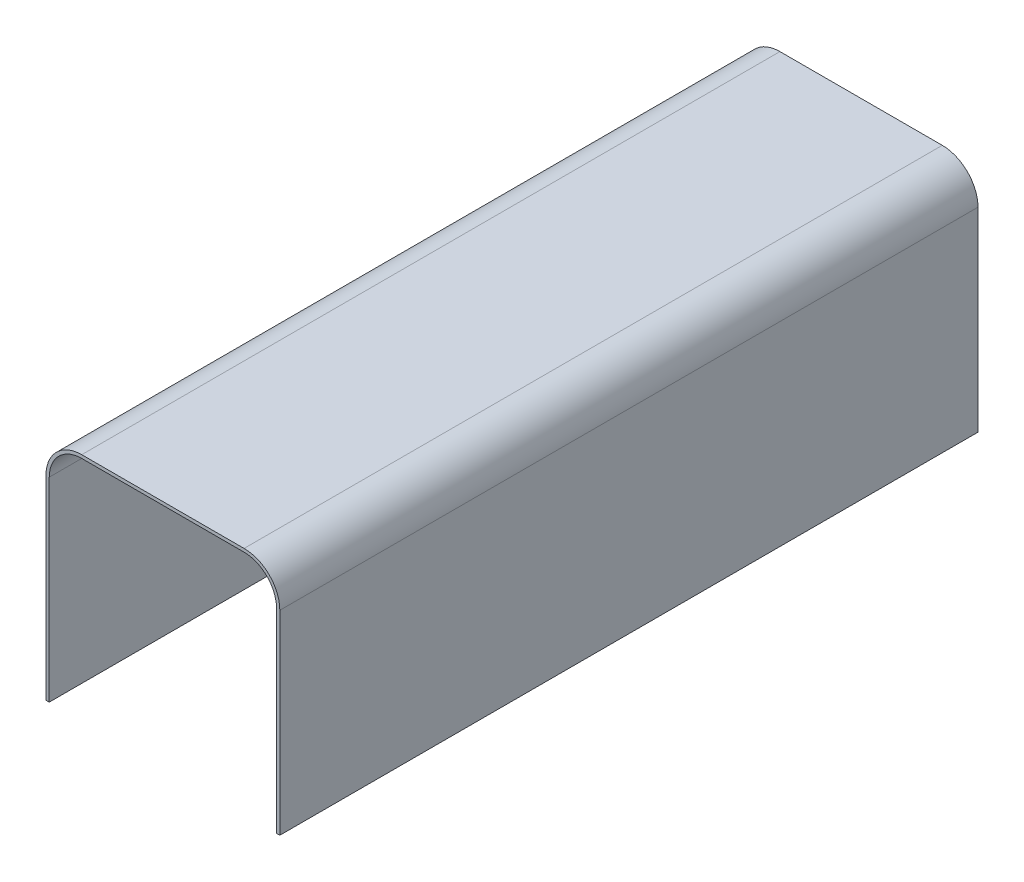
ISO-10303-21;
HEADER;
FILE_DESCRIPTION(('STEP AP214'),'2;1');
FILE_NAME('part.step','',(''),(''),'','','');
FILE_SCHEMA(('AUTOMOTIVE_DESIGN { 1 0 10303 214 1 1 1 1 }'));
ENDSEC;
DATA;
#1=APPLICATION_CONTEXT('core data for automotive mechanical design processes');
#2=APPLICATION_PROTOCOL_DEFINITION('international standard','automotive_design',2000,#1);
#3=PRODUCT_CONTEXT('',#1,'mechanical');
#4=PRODUCT('Part','Part','',(#3));
#5=PRODUCT_RELATED_PRODUCT_CATEGORY('part','',(#4));
#6=PRODUCT_DEFINITION_FORMATION('','',#4);
#7=PRODUCT_DEFINITION_CONTEXT('part definition',#1,'design');
#8=PRODUCT_DEFINITION('design','',#6,#7);
#9=PRODUCT_DEFINITION_SHAPE('','',#8);
#10=(LENGTH_UNIT() NAMED_UNIT(*) SI_UNIT(.MILLI.,.METRE.));
#11=(NAMED_UNIT(*) PLANE_ANGLE_UNIT() SI_UNIT($,.RADIAN.));
#12=(NAMED_UNIT(*) SI_UNIT($,.STERADIAN.) SOLID_ANGLE_UNIT());
#13=UNCERTAINTY_MEASURE_WITH_UNIT(LENGTH_MEASURE(1.E-05),#10,'distance_accuracy_value','');
#14=(GEOMETRIC_REPRESENTATION_CONTEXT(3) GLOBAL_UNCERTAINTY_ASSIGNED_CONTEXT((#13)) GLOBAL_UNIT_ASSIGNED_CONTEXT((#10,
#11,#12)) REPRESENTATION_CONTEXT('',''));
#15=CARTESIAN_POINT('',(0.,0.,0.));
#16=DIRECTION('',(0.,0.,1.));
#17=DIRECTION('',(1.,0.,0.));
#18=AXIS2_PLACEMENT_3D('',#15,#16,#17);
#19=CARTESIAN_POINT('',(-1.,0.,215.));
#20=DIRECTION('',(0.,1.,0.));
#21=DIRECTION('',(0.,0.,1.));
#22=AXIS2_PLACEMENT_3D('',#19,#20,#21);
#23=PLANE('',#22);
#24=DIRECTION('',(1.,0.,0.));
#25=VECTOR('',#24,1.);
#26=CARTESIAN_POINT('',(-1.,0.,0.));
#27=LINE('',#26,#25);
#28=CARTESIAN_POINT('',(-1.,0.,0.));
#29=VERTEX_POINT('',#28);
#30=CARTESIAN_POINT('',(0.,0.,0.));
#31=VERTEX_POINT('',#30);
#32=EDGE_CURVE('E153',#29,#31,#27,.T.);
#33=ORIENTED_EDGE('',*,*,#32,.T.);
#34=DIRECTION('',(0.,0.,-1.));
#35=VECTOR('',#34,1.);
#36=CARTESIAN_POINT('',(0.,0.,215.));
#37=LINE('',#36,#35);
#38=CARTESIAN_POINT('',(0.,0.,215.));
#39=VERTEX_POINT('',#38);
#40=EDGE_CURVE('E11',#39,#31,#37,.T.);
#41=ORIENTED_EDGE('',*,*,#40,.F.);
#42=DIRECTION('',(1.,0.,0.));
#43=VECTOR('',#42,1.);
#44=CARTESIAN_POINT('',(-1.,0.,215.));
#45=LINE('',#44,#43);
#46=CARTESIAN_POINT('',(-1.,0.,215.));
#47=VERTEX_POINT('',#46);
#48=EDGE_CURVE('E175',#47,#39,#45,.T.);
#49=ORIENTED_EDGE('',*,*,#48,.F.);
#50=DIRECTION('',(0.,0.,-1.));
#51=VECTOR('',#50,1.);
#52=CARTESIAN_POINT('',(-1.,0.,215.));
#53=LINE('',#52,#51);
#54=EDGE_CURVE('E149',#47,#29,#53,.T.);
#55=ORIENTED_EDGE('',*,*,#54,.T.);
#56=EDGE_LOOP('',(#33,#41,#49,#55));
#57=FACE_BOUND('',#56,.T.);
#58=ADVANCED_FACE('F33',(#57),#23,.F.);
#59=CARTESIAN_POINT('',(0.,0.,215.));
#60=DIRECTION('',(-1.,0.,0.));
#61=DIRECTION('',(0.,0.,1.));
#62=AXIS2_PLACEMENT_3D('',#59,#60,#61);
#63=PLANE('',#62);
#64=DIRECTION('',(0.,1.,0.));
#65=VECTOR('',#64,1.);
#66=CARTESIAN_POINT('',(0.,0.,0.));
#67=LINE('',#66,#65);
#68=CARTESIAN_POINT('',(0.,59.9999999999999,0.));
#69=VERTEX_POINT('',#68);
#70=EDGE_CURVE('E156',#31,#69,#67,.T.);
#71=ORIENTED_EDGE('',*,*,#70,.T.);
#72=DIRECTION('',(0.,0.,-1.));
#73=VECTOR('',#72,1.);
#74=CARTESIAN_POINT('',(0.,59.9999999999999,215.));
#75=LINE('',#74,#73);
#76=CARTESIAN_POINT('',(0.,59.9999999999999,215.));
#77=VERTEX_POINT('',#76);
#78=EDGE_CURVE('E41',#77,#69,#75,.T.);
#79=ORIENTED_EDGE('',*,*,#78,.F.);
#80=DIRECTION('',(0.,1.,0.));
#81=VECTOR('',#80,1.);
#82=CARTESIAN_POINT('',(0.,0.,215.));
#83=LINE('',#82,#81);
#84=EDGE_CURVE('E104',#39,#77,#83,.T.);
#85=ORIENTED_EDGE('',*,*,#84,.F.);
#86=ORIENTED_EDGE('',*,*,#40,.T.);
#87=EDGE_LOOP('',(#71,#79,#85,#86));
#88=FACE_BOUND('',#87,.T.);
#89=ADVANCED_FACE('F253',(#88),#63,.F.);
#90=CARTESIAN_POINT('',(10.,60.,215.));
#91=DIRECTION('',(0.,0.,-1.));
#92=DIRECTION('',(-1.,0.,0.));
#93=AXIS2_PLACEMENT_3D('',#90,#91,#92);
#94=CYLINDRICAL_SURFACE('',#93,10.);
#95=CARTESIAN_POINT('',(10.,60.,0.));
#96=DIRECTION('',(0.,0.,-1.));
#97=DIRECTION('',(-1.,0.,0.));
#98=AXIS2_PLACEMENT_3D('',#95,#96,#97);
#99=CIRCLE('',#98,10.);
#100=CARTESIAN_POINT('',(10.0000000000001,70.,0.));
#101=VERTEX_POINT('',#100);
#102=EDGE_CURVE('E158',#69,#101,#99,.T.);
#103=ORIENTED_EDGE('',*,*,#102,.T.);
#104=DIRECTION('',(0.,0.,-1.));
#105=VECTOR('',#104,1.);
#106=CARTESIAN_POINT('',(10.0000000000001,70.,215.));
#107=LINE('',#106,#105);
#108=CARTESIAN_POINT('',(10.0000000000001,70.,215.));
#109=VERTEX_POINT('',#108);
#110=EDGE_CURVE('E194',#109,#101,#107,.T.);
#111=ORIENTED_EDGE('',*,*,#110,.F.);
#112=CARTESIAN_POINT('',(10.,60.,215.));
#113=DIRECTION('',(0.,0.,-1.));
#114=DIRECTION('',(-1.,0.,0.));
#115=AXIS2_PLACEMENT_3D('',#112,#113,#114);
#116=CIRCLE('',#115,10.);
#117=EDGE_CURVE('E202',#77,#109,#116,.T.);
#118=ORIENTED_EDGE('',*,*,#117,.F.);
#119=ORIENTED_EDGE('',*,*,#78,.T.);
#120=EDGE_LOOP('',(#103,#111,#118,#119));
#121=FACE_BOUND('',#120,.T.);
#122=ADVANCED_FACE('F200',(#121),#94,.F.);
#123=CARTESIAN_POINT('',(10.0000000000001,70.,215.));
#124=DIRECTION('',(0.,1.,0.));
#125=DIRECTION('',(0.,0.,1.));
#126=AXIS2_PLACEMENT_3D('',#123,#124,#125);
#127=PLANE('',#126);
#128=DIRECTION('',(1.,0.,0.));
#129=VECTOR('',#128,1.);
#130=CARTESIAN_POINT('',(10.0000000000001,70.,0.));
#131=LINE('',#130,#129);
#132=CARTESIAN_POINT('',(59.9999999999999,70.,0.));
#133=VERTEX_POINT('',#132);
#134=EDGE_CURVE('E160',#101,#133,#131,.T.);
#135=ORIENTED_EDGE('',*,*,#134,.T.);
#136=DIRECTION('',(0.,0.,-1.));
#137=VECTOR('',#136,1.);
#138=CARTESIAN_POINT('',(59.9999999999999,70.,215.));
#139=LINE('',#138,#137);
#140=CARTESIAN_POINT('',(59.9999999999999,70.,215.));
#141=VERTEX_POINT('',#140);
#142=EDGE_CURVE('E191',#141,#133,#139,.T.);
#143=ORIENTED_EDGE('',*,*,#142,.F.);
#144=DIRECTION('',(1.,0.,0.));
#145=VECTOR('',#144,1.);
#146=CARTESIAN_POINT('',(10.0000000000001,70.,215.));
#147=LINE('',#146,#145);
#148=EDGE_CURVE('E220',#109,#141,#147,.T.);
#149=ORIENTED_EDGE('',*,*,#148,.F.);
#150=ORIENTED_EDGE('',*,*,#110,.T.);
#151=EDGE_LOOP('',(#135,#143,#149,#150));
#152=FACE_BOUND('',#151,.T.);
#153=ADVANCED_FACE('F211',(#152),#127,.F.);
#154=CARTESIAN_POINT('',(60.,60.,215.));
#155=DIRECTION('',(0.,0.,-1.));
#156=DIRECTION('',(-1.,0.,0.));
#157=AXIS2_PLACEMENT_3D('',#154,#155,#156);
#158=CYLINDRICAL_SURFACE('',#157,10.);
#159=CARTESIAN_POINT('',(60.,60.,0.));
#160=DIRECTION('',(0.,0.,-1.));
#161=DIRECTION('',(-1.,0.,0.));
#162=AXIS2_PLACEMENT_3D('',#159,#160,#161);
#163=CIRCLE('',#162,10.);
#164=CARTESIAN_POINT('',(70.,59.9999999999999,0.));
#165=VERTEX_POINT('',#164);
#166=EDGE_CURVE('E162',#133,#165,#163,.T.);
#167=ORIENTED_EDGE('',*,*,#166,.T.);
#168=DIRECTION('',(0.,0.,-1.));
#169=VECTOR('',#168,1.);
#170=CARTESIAN_POINT('',(70.,59.9999999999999,215.));
#171=LINE('',#170,#169);
#172=CARTESIAN_POINT('',(70.,59.9999999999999,215.));
#173=VERTEX_POINT('',#172);
#174=EDGE_CURVE('E188',#173,#165,#171,.T.);
#175=ORIENTED_EDGE('',*,*,#174,.F.);
#176=CARTESIAN_POINT('',(60.,60.,215.));
#177=DIRECTION('',(0.,0.,-1.));
#178=DIRECTION('',(-1.,0.,0.));
#179=AXIS2_PLACEMENT_3D('',#176,#177,#178);
#180=CIRCLE('',#179,10.);
#181=EDGE_CURVE('E217',#141,#173,#180,.T.);
#182=ORIENTED_EDGE('',*,*,#181,.F.);
#183=ORIENTED_EDGE('',*,*,#142,.T.);
#184=EDGE_LOOP('',(#167,#175,#182,#183));
#185=FACE_BOUND('',#184,.T.);
#186=ADVANCED_FACE('F215',(#185),#158,.F.);
#187=CARTESIAN_POINT('',(70.,59.9999999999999,215.));
#188=DIRECTION('',(1.,0.,0.));
#189=DIRECTION('',(0.,1.,0.));
#190=AXIS2_PLACEMENT_3D('',#187,#188,#189);
#191=PLANE('',#190);
#192=DIRECTION('',(0.,-1.,0.));
#193=VECTOR('',#192,1.);
#194=CARTESIAN_POINT('',(70.,59.9999999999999,0.));
#195=LINE('',#194,#193);
#196=CARTESIAN_POINT('',(70.,0.,0.));
#197=VERTEX_POINT('',#196);
#198=EDGE_CURVE('E164',#165,#197,#195,.T.);
#199=ORIENTED_EDGE('',*,*,#198,.T.);
#200=DIRECTION('',(0.,0.,-1.));
#201=VECTOR('',#200,1.);
#202=CARTESIAN_POINT('',(70.,0.,215.));
#203=LINE('',#202,#201);
#204=CARTESIAN_POINT('',(70.,0.,215.));
#205=VERTEX_POINT('',#204);
#206=EDGE_CURVE('E185',#205,#197,#203,.T.);
#207=ORIENTED_EDGE('',*,*,#206,.F.);
#208=DIRECTION('',(0.,-1.,0.));
#209=VECTOR('',#208,1.);
#210=CARTESIAN_POINT('',(70.,59.9999999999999,215.));
#211=LINE('',#210,#209);
#212=EDGE_CURVE('E219',#173,#205,#211,.T.);
#213=ORIENTED_EDGE('',*,*,#212,.F.);
#214=ORIENTED_EDGE('',*,*,#174,.T.);
#215=EDGE_LOOP('',(#199,#207,#213,#214));
#216=FACE_BOUND('',#215,.T.);
#217=ADVANCED_FACE('F266',(#216),#191,.F.);
#218=CARTESIAN_POINT('',(70.,0.,215.));
#219=DIRECTION('',(0.,1.,0.));
#220=DIRECTION('',(0.,0.,1.));
#221=AXIS2_PLACEMENT_3D('',#218,#219,#220);
#222=PLANE('',#221);
#223=DIRECTION('',(1.,0.,0.));
#224=VECTOR('',#223,1.);
#225=CARTESIAN_POINT('',(70.,0.,0.));
#226=LINE('',#225,#224);
#227=CARTESIAN_POINT('',(71.,0.,0.));
#228=VERTEX_POINT('',#227);
#229=EDGE_CURVE('E166',#197,#228,#226,.T.);
#230=ORIENTED_EDGE('',*,*,#229,.T.);
#231=DIRECTION('',(0.,0.,-1.));
#232=VECTOR('',#231,1.);
#233=CARTESIAN_POINT('',(71.,0.,215.));
#234=LINE('',#233,#232);
#235=CARTESIAN_POINT('',(71.,0.,215.));
#236=VERTEX_POINT('',#235);
#237=EDGE_CURVE('E182',#236,#228,#234,.T.);
#238=ORIENTED_EDGE('',*,*,#237,.F.);
#239=DIRECTION('',(1.,0.,0.));
#240=VECTOR('',#239,1.);
#241=CARTESIAN_POINT('',(70.,0.,215.));
#242=LINE('',#241,#240);
#243=EDGE_CURVE('E222',#205,#236,#242,.T.);
#244=ORIENTED_EDGE('',*,*,#243,.F.);
#245=ORIENTED_EDGE('',*,*,#206,.T.);
#246=EDGE_LOOP('',(#230,#238,#244,#245));
#247=FACE_BOUND('',#246,.T.);
#248=ADVANCED_FACE('F269',(#247),#222,.F.);
#249=CARTESIAN_POINT('',(71.,59.9999999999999,215.));
#250=DIRECTION('',(-1.,0.,0.));
#251=DIRECTION('',(0.,0.,1.));
#252=AXIS2_PLACEMENT_3D('',#249,#250,#251);
#253=PLANE('',#252);
#254=DIRECTION('',(0.,1.,0.));
#255=VECTOR('',#254,1.);
#256=CARTESIAN_POINT('',(71.,59.9999999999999,0.));
#257=LINE('',#256,#255);
#258=CARTESIAN_POINT('',(71.,59.9999999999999,0.));
#259=VERTEX_POINT('',#258);
#260=EDGE_CURVE('E168',#228,#259,#257,.T.);
#261=ORIENTED_EDGE('',*,*,#260,.T.);
#262=DIRECTION('',(0.,0.,-1.));
#263=VECTOR('',#262,1.);
#264=CARTESIAN_POINT('',(71.,59.9999999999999,215.));
#265=LINE('',#264,#263);
#266=CARTESIAN_POINT('',(71.,59.9999999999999,215.));
#267=VERTEX_POINT('',#266);
#268=EDGE_CURVE('E179',#267,#259,#265,.T.);
#269=ORIENTED_EDGE('',*,*,#268,.F.);
#270=DIRECTION('',(0.,1.,0.));
#271=VECTOR('',#270,1.);
#272=CARTESIAN_POINT('',(71.,59.9999999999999,215.));
#273=LINE('',#272,#271);
#274=EDGE_CURVE('E228',#236,#267,#273,.T.);
#275=ORIENTED_EDGE('',*,*,#274,.F.);
#276=ORIENTED_EDGE('',*,*,#237,.T.);
#277=EDGE_LOOP('',(#261,#269,#275,#276));
#278=FACE_BOUND('',#277,.T.);
#279=ADVANCED_FACE('F234',(#278),#253,.F.);
#280=CARTESIAN_POINT('',(60.,60.,215.));
#281=DIRECTION('',(0.,0.,-1.));
#282=DIRECTION('',(-1.,0.,0.));
#283=AXIS2_PLACEMENT_3D('',#280,#281,#282);
#284=CYLINDRICAL_SURFACE('',#283,11.);
#285=CARTESIAN_POINT('',(60.,60.,0.));
#286=DIRECTION('',(0.,0.,1.));
#287=DIRECTION('',(-1.,0.,0.));
#288=AXIS2_PLACEMENT_3D('',#285,#286,#287);
#289=CIRCLE('',#288,11.);
#290=CARTESIAN_POINT('',(59.9999999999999,71.,0.));
#291=VERTEX_POINT('',#290);
#292=EDGE_CURVE('E170',#259,#291,#289,.T.);
#293=ORIENTED_EDGE('',*,*,#292,.T.);
#294=DIRECTION('',(0.,0.,-1.));
#295=VECTOR('',#294,1.);
#296=CARTESIAN_POINT('',(59.9999999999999,71.,215.));
#297=LINE('',#296,#295);
#298=CARTESIAN_POINT('',(59.9999999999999,71.,215.));
#299=VERTEX_POINT('',#298);
#300=EDGE_CURVE('E144',#299,#291,#297,.T.);
#301=ORIENTED_EDGE('',*,*,#300,.F.);
#302=CARTESIAN_POINT('',(60.,60.,215.));
#303=DIRECTION('',(0.,0.,1.));
#304=DIRECTION('',(-1.,0.,0.));
#305=AXIS2_PLACEMENT_3D('',#302,#303,#304);
#306=CIRCLE('',#305,11.);
#307=EDGE_CURVE('E135',#267,#299,#306,.T.);
#308=ORIENTED_EDGE('',*,*,#307,.F.);
#309=ORIENTED_EDGE('',*,*,#268,.T.);
#310=EDGE_LOOP('',(#293,#301,#308,#309));
#311=FACE_BOUND('',#310,.T.);
#312=ADVANCED_FACE('F238',(#311),#284,.T.);
#313=CARTESIAN_POINT('',(10.0000000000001,71.,215.));
#314=DIRECTION('',(0.,-1.,0.));
#315=DIRECTION('',(0.,0.,-1.));
#316=AXIS2_PLACEMENT_3D('',#313,#314,#315);
#317=PLANE('',#316);
#318=DIRECTION('',(-1.,0.,0.));
#319=VECTOR('',#318,1.);
#320=CARTESIAN_POINT('',(10.0000000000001,71.,0.));
#321=LINE('',#320,#319);
#322=CARTESIAN_POINT('',(10.0000000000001,71.,0.));
#323=VERTEX_POINT('',#322);
#324=EDGE_CURVE('E143',#291,#323,#321,.T.);
#325=ORIENTED_EDGE('',*,*,#324,.T.);
#326=DIRECTION('',(0.,0.,-1.));
#327=VECTOR('',#326,1.);
#328=CARTESIAN_POINT('',(10.0000000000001,71.,215.));
#329=LINE('',#328,#327);
#330=CARTESIAN_POINT('',(10.0000000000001,71.,215.));
#331=VERTEX_POINT('',#330);
#332=EDGE_CURVE('E140',#331,#323,#329,.T.);
#333=ORIENTED_EDGE('',*,*,#332,.F.);
#334=DIRECTION('',(-1.,0.,0.));
#335=VECTOR('',#334,1.);
#336=CARTESIAN_POINT('',(10.0000000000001,71.,215.));
#337=LINE('',#336,#335);
#338=EDGE_CURVE('E129',#299,#331,#337,.T.);
#339=ORIENTED_EDGE('',*,*,#338,.F.);
#340=ORIENTED_EDGE('',*,*,#300,.T.);
#341=EDGE_LOOP('',(#325,#333,#339,#340));
#342=FACE_BOUND('',#341,.T.);
#343=ADVANCED_FACE('F141',(#342),#317,.F.);
#344=CARTESIAN_POINT('',(10.,60.,215.));
#345=DIRECTION('',(0.,0.,-1.));
#346=DIRECTION('',(-1.,0.,0.));
#347=AXIS2_PLACEMENT_3D('',#344,#345,#346);
#348=CYLINDRICAL_SURFACE('',#347,11.);
#349=CARTESIAN_POINT('',(10.,60.,0.));
#350=DIRECTION('',(0.,0.,1.));
#351=DIRECTION('',(-1.,0.,0.));
#352=AXIS2_PLACEMENT_3D('',#349,#350,#351);
#353=CIRCLE('',#352,11.);
#354=CARTESIAN_POINT('',(-1.,59.9999999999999,0.));
#355=VERTEX_POINT('',#354);
#356=EDGE_CURVE('E90',#323,#355,#353,.T.);
#357=ORIENTED_EDGE('',*,*,#356,.T.);
#358=DIRECTION('',(0.,0.,-1.));
#359=VECTOR('',#358,1.);
#360=CARTESIAN_POINT('',(-1.,59.9999999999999,215.));
#361=LINE('',#360,#359);
#362=CARTESIAN_POINT('',(-1.,59.9999999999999,215.));
#363=VERTEX_POINT('',#362);
#364=EDGE_CURVE('E145',#363,#355,#361,.T.);
#365=ORIENTED_EDGE('',*,*,#364,.F.);
#366=CARTESIAN_POINT('',(10.,60.,215.));
#367=DIRECTION('',(0.,0.,1.));
#368=DIRECTION('',(-1.,0.,0.));
#369=AXIS2_PLACEMENT_3D('',#366,#367,#368);
#370=CIRCLE('',#369,11.);
#371=EDGE_CURVE('E133',#331,#363,#370,.T.);
#372=ORIENTED_EDGE('',*,*,#371,.F.);
#373=ORIENTED_EDGE('',*,*,#332,.T.);
#374=EDGE_LOOP('',(#357,#365,#372,#373));
#375=FACE_BOUND('',#374,.T.);
#376=ADVANCED_FACE('F147',(#375),#348,.T.);
#377=CARTESIAN_POINT('',(-1.,0.,215.));
#378=DIRECTION('',(1.,0.,0.));
#379=DIRECTION('',(0.,0.,-1.));
#380=AXIS2_PLACEMENT_3D('',#377,#378,#379);
#381=PLANE('',#380);
#382=DIRECTION('',(0.,-1.,0.));
#383=VECTOR('',#382,1.);
#384=CARTESIAN_POINT('',(-1.,0.,0.));
#385=LINE('',#384,#383);
#386=EDGE_CURVE('E96',#355,#29,#385,.T.);
#387=ORIENTED_EDGE('',*,*,#386,.T.);
#388=ORIENTED_EDGE('',*,*,#54,.F.);
#389=DIRECTION('',(0.,-1.,0.));
#390=VECTOR('',#389,1.);
#391=CARTESIAN_POINT('',(-1.,0.,215.));
#392=LINE('',#391,#390);
#393=EDGE_CURVE('E49',#363,#47,#392,.T.);
#394=ORIENTED_EDGE('',*,*,#393,.F.);
#395=ORIENTED_EDGE('',*,*,#364,.T.);
#396=EDGE_LOOP('',(#387,#388,#394,#395));
#397=FACE_BOUND('',#396,.T.);
#398=ADVANCED_FACE('F242',(#397),#381,.F.);
#399=CARTESIAN_POINT('',(10.,60.,215.));
#400=DIRECTION('',(0.,0.,-1.));
#401=DIRECTION('',(-1.,0.,0.));
#402=AXIS2_PLACEMENT_3D('',#399,#400,#401);
#403=PLANE('',#402);
#404=ORIENTED_EDGE('',*,*,#48,.T.);
#405=ORIENTED_EDGE('',*,*,#84,.T.);
#406=ORIENTED_EDGE('',*,*,#117,.T.);
#407=ORIENTED_EDGE('',*,*,#148,.T.);
#408=ORIENTED_EDGE('',*,*,#181,.T.);
#409=ORIENTED_EDGE('',*,*,#212,.T.);
#410=ORIENTED_EDGE('',*,*,#243,.T.);
#411=ORIENTED_EDGE('',*,*,#274,.T.);
#412=ORIENTED_EDGE('',*,*,#307,.T.);
#413=ORIENTED_EDGE('',*,*,#338,.T.);
#414=ORIENTED_EDGE('',*,*,#371,.T.);
#415=ORIENTED_EDGE('',*,*,#393,.T.);
#416=EDGE_LOOP('',(#404,#405,#406,#407,#408,#409,#410,#411,#412,#413,#414,#415));
#417=FACE_BOUND('',#416,.T.);
#418=ADVANCED_FACE('F131',(#417),#403,.F.);
#419=CARTESIAN_POINT('',(10.,60.,0.));
#420=DIRECTION('',(0.,0.,-1.));
#421=DIRECTION('',(-1.,0.,0.));
#422=AXIS2_PLACEMENT_3D('',#419,#420,#421);
#423=PLANE('',#422);
#424=ORIENTED_EDGE('',*,*,#32,.F.);
#425=ORIENTED_EDGE('',*,*,#386,.F.);
#426=ORIENTED_EDGE('',*,*,#356,.F.);
#427=ORIENTED_EDGE('',*,*,#324,.F.);
#428=ORIENTED_EDGE('',*,*,#292,.F.);
#429=ORIENTED_EDGE('',*,*,#260,.F.);
#430=ORIENTED_EDGE('',*,*,#229,.F.);
#431=ORIENTED_EDGE('',*,*,#198,.F.);
#432=ORIENTED_EDGE('',*,*,#166,.F.);
#433=ORIENTED_EDGE('',*,*,#134,.F.);
#434=ORIENTED_EDGE('',*,*,#102,.F.);
#435=ORIENTED_EDGE('',*,*,#70,.F.);
#436=EDGE_LOOP('',(#424,#425,#426,#427,#428,#429,#430,#431,#432,#433,#434,#435));
#437=FACE_BOUND('',#436,.T.);
#438=ADVANCED_FACE('F206',(#437),#423,.T.);
#439=CLOSED_SHELL('',(#58,#89,#122,#153,#186,#217,#248,#279,#312,#343,#376,#398,#418,#438));
#440=MANIFOLD_SOLID_BREP('B2',#439);
#441=ADVANCED_BREP_SHAPE_REPRESENTATION('',(#18,#440),#14);
#442=SHAPE_DEFINITION_REPRESENTATION(#9,#441);
ENDSEC;
END-ISO-10303-21;
